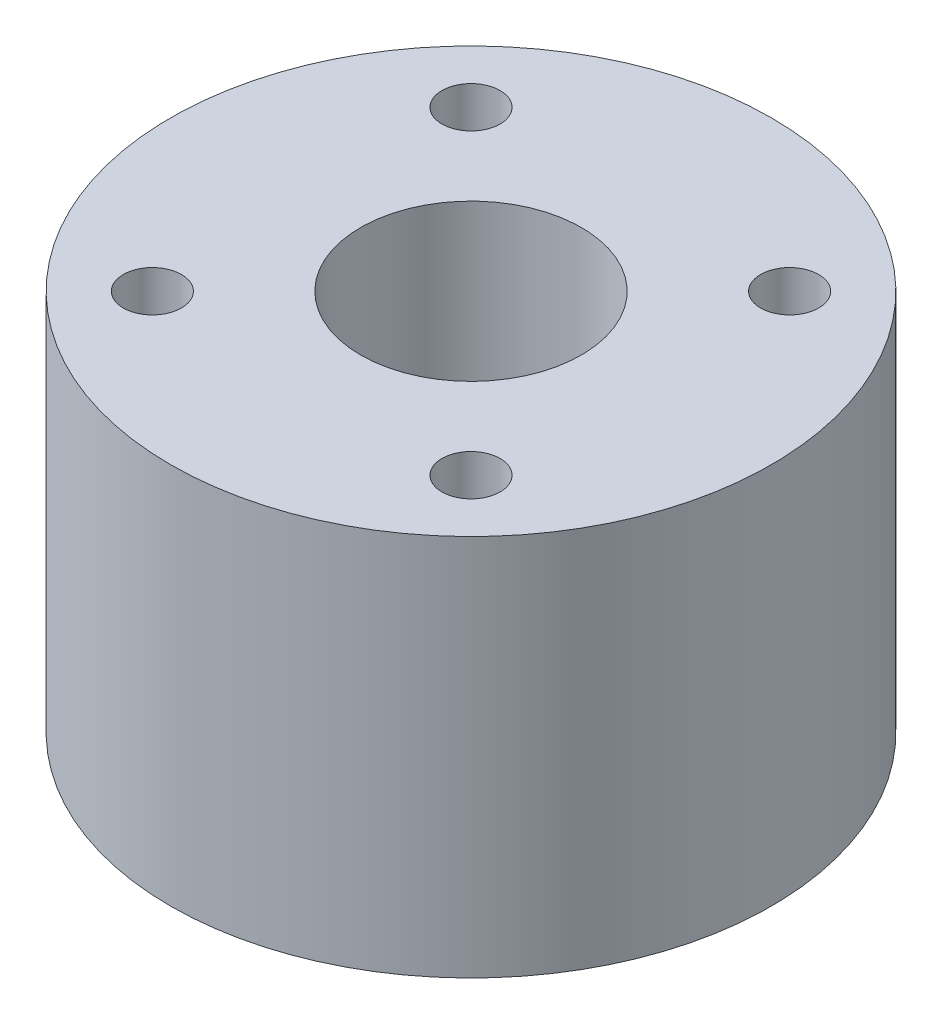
from build123d import *

# Parameters (mm, degrees)
BOSS_EXTRUDE2_START     = 0.01016
SKETCH2_R               = 34.925
BOSS_EXTRUDE2_DEPTH     = 44.45
F_1_4_CLEARANCE_HOLE1_D = 6.7564
CIRPATTERN1_COUNT       = 4
SKETCH9_R               = 12.839655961
CUT_EXTRUDE1_DEPTH      = 32.54375
SKETCH10_R              = 3.755962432
CUT_EXTRUDE2_DEPTH      = 60.149022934


with BuildPart() as part:
    # Sketch2 → Boss-Extrude2 (new body)
    with BuildSketch(Plane.XZ.offset(BOSS_EXTRUDE2_START)):
        with Locations(Location((0, 0, 0), (0, 0, 90))):
            Circle(SKETCH2_R)
    extrude(amount=BOSS_EXTRUDE2_DEPTH)

    # 1_4 Clearance Hole1 (through all)
    with Locations(Plane(origin=(0, -0.01016, 0), x_dir=(-1, 0, 0), z_dir=(0, 1, 0))):
        with Locations((-18.52177825, 18.52177825)):
            f_1_4_clearance_hole1 = Hole(F_1_4_CLEARANCE_HOLE1_D / 2)

    # CirPattern1: 1_4 Clearance Hole1 ×4 about axis
    cirpattern1_axis = Axis((0, 0, 0), (0, 1, 0))
    for i in range(1, CIRPATTERN1_COUNT):
        add(f_1_4_clearance_hole1.rotate(cirpattern1_axis, i * 360 / CIRPATTERN1_COUNT), mode=Mode.SUBTRACT)

    # Sketch9 → Cut-Extrude1 (cut)
    with BuildSketch(Plane(origin=(0, -0.01016, 0), x_dir=(1, 0, 0), z_dir=(0, 1, 0))):
        with Locations(Location((0, 0, 0), (0, 0, 270))):
            Circle(SKETCH9_R)
    extrude(amount=-CUT_EXTRUDE1_DEPTH, mode=Mode.SUBTRACT)

    # Sketch10 → Cut-Extrude2 (cut, through all)
    with BuildSketch(Plane(origin=(0, -32.55391, 0), x_dir=(1, 0, 0), z_dir=(0, 1, 0))):
        with Locations(Location((0, 0, 0), (0, 0, 270))):
            Circle(SKETCH10_R)
    extrude(amount=-CUT_EXTRUDE2_DEPTH, mode=Mode.SUBTRACT)


solid = part.part
